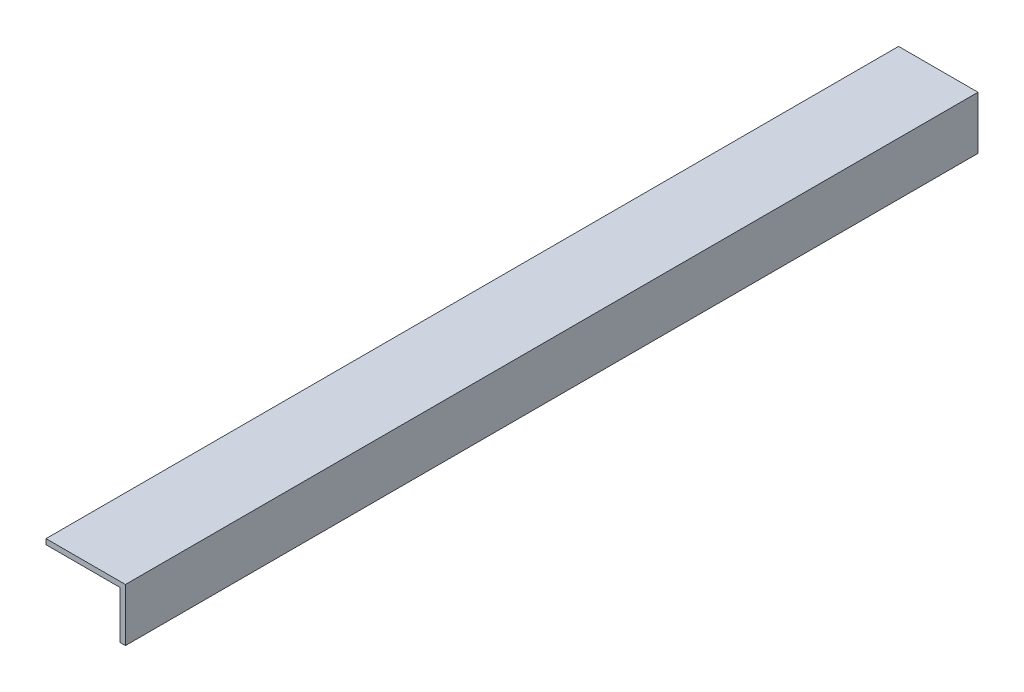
ISO-10303-21;
HEADER;
FILE_DESCRIPTION(('STEP AP214'),'2;1');
FILE_NAME('part.step','',(''),(''),'','','');
FILE_SCHEMA(('AUTOMOTIVE_DESIGN { 1 0 10303 214 1 1 1 1 }'));
ENDSEC;
DATA;
#1=APPLICATION_CONTEXT('core data for automotive mechanical design processes');
#2=APPLICATION_PROTOCOL_DEFINITION('international standard','automotive_design',2000,#1);
#3=PRODUCT_CONTEXT('',#1,'mechanical');
#4=PRODUCT('Part','Part','',(#3));
#5=PRODUCT_RELATED_PRODUCT_CATEGORY('part','',(#4));
#6=PRODUCT_DEFINITION_FORMATION('','',#4);
#7=PRODUCT_DEFINITION_CONTEXT('part definition',#1,'design');
#8=PRODUCT_DEFINITION('design','',#6,#7);
#9=PRODUCT_DEFINITION_SHAPE('','',#8);
#10=(LENGTH_UNIT() NAMED_UNIT(*) SI_UNIT(.MILLI.,.METRE.));
#11=(NAMED_UNIT(*) PLANE_ANGLE_UNIT() SI_UNIT($,.RADIAN.));
#12=(NAMED_UNIT(*) SI_UNIT($,.STERADIAN.) SOLID_ANGLE_UNIT());
#13=UNCERTAINTY_MEASURE_WITH_UNIT(LENGTH_MEASURE(1.E-05),#10,'distance_accuracy_value','');
#14=(GEOMETRIC_REPRESENTATION_CONTEXT(3) GLOBAL_UNCERTAINTY_ASSIGNED_CONTEXT((#13)) GLOBAL_UNIT_ASSIGNED_CONTEXT((#10,
#11,#12)) REPRESENTATION_CONTEXT('',''));
#15=CARTESIAN_POINT('',(0.,0.,0.));
#16=DIRECTION('',(0.,0.,1.));
#17=DIRECTION('',(1.,0.,0.));
#18=AXIS2_PLACEMENT_3D('',#15,#16,#17);
#19=CARTESIAN_POINT('',(0.,0.,161.));
#20=DIRECTION('',(1.,0.,0.));
#21=DIRECTION('',(0.,0.,-1.));
#22=AXIS2_PLACEMENT_3D('',#19,#20,#21);
#23=PLANE('',#22);
#24=DIRECTION('',(0.,-1.,0.));
#25=VECTOR('',#24,1.);
#26=CARTESIAN_POINT('',(0.,0.,0.));
#27=LINE('',#26,#25);
#28=CARTESIAN_POINT('',(0.,10.,0.));
#29=VERTEX_POINT('',#28);
#30=CARTESIAN_POINT('',(0.,9.,0.));
#31=VERTEX_POINT('',#30);
#32=EDGE_CURVE('E103',#29,#31,#27,.T.);
#33=ORIENTED_EDGE('',*,*,#32,.T.);
#34=DIRECTION('',(0.,0.,-1.));
#35=VECTOR('',#34,1.);
#36=CARTESIAN_POINT('',(0.,9.,161.));
#37=LINE('',#36,#35);
#38=CARTESIAN_POINT('',(0.,9.,161.));
#39=VERTEX_POINT('',#38);
#40=EDGE_CURVE('E44',#39,#31,#37,.T.);
#41=ORIENTED_EDGE('',*,*,#40,.F.);
#42=DIRECTION('',(0.,-1.,0.));
#43=VECTOR('',#42,1.);
#44=CARTESIAN_POINT('',(0.,0.,161.));
#45=LINE('',#44,#43);
#46=CARTESIAN_POINT('',(0.,10.,161.));
#47=VERTEX_POINT('',#46);
#48=EDGE_CURVE('E101',#47,#39,#45,.T.);
#49=ORIENTED_EDGE('',*,*,#48,.F.);
#50=DIRECTION('',(0.,0.,-1.));
#51=VECTOR('',#50,1.);
#52=CARTESIAN_POINT('',(0.,10.,161.));
#53=LINE('',#52,#51);
#54=EDGE_CURVE('E115',#47,#29,#53,.T.);
#55=ORIENTED_EDGE('',*,*,#54,.T.);
#56=EDGE_LOOP('',(#33,#41,#49,#55));
#57=FACE_BOUND('',#56,.T.);
#58=ADVANCED_FACE('F30',(#57),#23,.F.);
#59=CARTESIAN_POINT('',(0.,0.,161.));
#60=DIRECTION('',(0.,1.,0.));
#61=DIRECTION('',(0.,0.,1.));
#62=AXIS2_PLACEMENT_3D('',#59,#60,#61);
#63=PLANE('',#62);
#64=DIRECTION('',(1.,0.,0.));
#65=VECTOR('',#64,1.);
#66=CARTESIAN_POINT('',(0.,0.,161.));
#67=LINE('',#66,#65);
#68=CARTESIAN_POINT('',(14.,0.,161.));
#69=VERTEX_POINT('',#68);
#70=CARTESIAN_POINT('',(15.,0.,161.));
#71=VERTEX_POINT('',#70);
#72=EDGE_CURVE('E75',#69,#71,#67,.T.);
#73=ORIENTED_EDGE('',*,*,#72,.F.);
#74=DIRECTION('',(0.,0.,-1.));
#75=VECTOR('',#74,1.);
#76=CARTESIAN_POINT('',(14.,0.,161.));
#77=LINE('',#76,#75);
#78=CARTESIAN_POINT('',(14.,0.,0.));
#79=VERTEX_POINT('',#78);
#80=EDGE_CURVE('E118',#69,#79,#77,.T.);
#81=ORIENTED_EDGE('',*,*,#80,.T.);
#82=DIRECTION('',(1.,0.,0.));
#83=VECTOR('',#82,1.);
#84=CARTESIAN_POINT('',(0.,0.,0.));
#85=LINE('',#84,#83);
#86=CARTESIAN_POINT('',(15.,0.,0.));
#87=VERTEX_POINT('',#86);
#88=EDGE_CURVE('E117',#79,#87,#85,.T.);
#89=ORIENTED_EDGE('',*,*,#88,.T.);
#90=DIRECTION('',(0.,0.,-1.));
#91=VECTOR('',#90,1.);
#92=CARTESIAN_POINT('',(15.,0.,161.));
#93=LINE('',#92,#91);
#94=EDGE_CURVE('E11',#71,#87,#93,.T.);
#95=ORIENTED_EDGE('',*,*,#94,.F.);
#96=EDGE_LOOP('',(#73,#81,#89,#95));
#97=FACE_BOUND('',#96,.T.);
#98=ADVANCED_FACE('F139',(#97),#63,.F.);
#99=CARTESIAN_POINT('',(15.,0.,161.));
#100=DIRECTION('',(-1.,0.,0.));
#101=DIRECTION('',(0.,0.,1.));
#102=AXIS2_PLACEMENT_3D('',#99,#100,#101);
#103=PLANE('',#102);
#104=DIRECTION('',(0.,1.,0.));
#105=VECTOR('',#104,1.);
#106=CARTESIAN_POINT('',(15.,0.,0.));
#107=LINE('',#106,#105);
#108=CARTESIAN_POINT('',(15.,10.,0.));
#109=VERTEX_POINT('',#108);
#110=EDGE_CURVE('E109',#87,#109,#107,.T.);
#111=ORIENTED_EDGE('',*,*,#110,.T.);
#112=DIRECTION('',(0.,0.,-1.));
#113=VECTOR('',#112,1.);
#114=CARTESIAN_POINT('',(15.,10.,161.));
#115=LINE('',#114,#113);
#116=CARTESIAN_POINT('',(15.,10.,161.));
#117=VERTEX_POINT('',#116);
#118=EDGE_CURVE('E37',#117,#109,#115,.T.);
#119=ORIENTED_EDGE('',*,*,#118,.F.);
#120=DIRECTION('',(0.,1.,0.));
#121=VECTOR('',#120,1.);
#122=CARTESIAN_POINT('',(15.,0.,161.));
#123=LINE('',#122,#121);
#124=EDGE_CURVE('E107',#71,#117,#123,.T.);
#125=ORIENTED_EDGE('',*,*,#124,.F.);
#126=ORIENTED_EDGE('',*,*,#94,.T.);
#127=EDGE_LOOP('',(#111,#119,#125,#126));
#128=FACE_BOUND('',#127,.T.);
#129=ADVANCED_FACE('F140',(#128),#103,.F.);
#130=CARTESIAN_POINT('',(0.,10.,161.));
#131=DIRECTION('',(0.,-1.,0.));
#132=DIRECTION('',(0.,0.,-1.));
#133=AXIS2_PLACEMENT_3D('',#130,#131,#132);
#134=PLANE('',#133);
#135=DIRECTION('',(-1.,0.,0.));
#136=VECTOR('',#135,1.);
#137=CARTESIAN_POINT('',(0.,10.,0.));
#138=LINE('',#137,#136);
#139=EDGE_CURVE('E70',#109,#29,#138,.T.);
#140=ORIENTED_EDGE('',*,*,#139,.T.);
#141=ORIENTED_EDGE('',*,*,#54,.F.);
#142=DIRECTION('',(-1.,0.,0.));
#143=VECTOR('',#142,1.);
#144=CARTESIAN_POINT('',(0.,10.,161.));
#145=LINE('',#144,#143);
#146=EDGE_CURVE('E53',#117,#47,#145,.T.);
#147=ORIENTED_EDGE('',*,*,#146,.F.);
#148=ORIENTED_EDGE('',*,*,#118,.T.);
#149=EDGE_LOOP('',(#140,#141,#147,#148));
#150=FACE_BOUND('',#149,.T.);
#151=ADVANCED_FACE('F122',(#150),#134,.F.);
#152=CARTESIAN_POINT('',(0.,10.,161.));
#153=DIRECTION('',(0.,0.,-1.));
#154=DIRECTION('',(-1.,0.,0.));
#155=AXIS2_PLACEMENT_3D('',#152,#153,#154);
#156=PLANE('',#155);
#157=DIRECTION('',(1.,0.,0.));
#158=VECTOR('',#157,1.);
#159=CARTESIAN_POINT('',(0.,9.,161.));
#160=LINE('',#159,#158);
#161=CARTESIAN_POINT('',(14.,9.,161.));
#162=VERTEX_POINT('',#161);
#163=EDGE_CURVE('E91',#39,#162,#160,.T.);
#164=ORIENTED_EDGE('',*,*,#163,.T.);
#165=DIRECTION('',(0.,-1.,0.));
#166=VECTOR('',#165,1.);
#167=CARTESIAN_POINT('',(14.,0.,161.));
#168=LINE('',#167,#166);
#169=EDGE_CURVE('E95',#162,#69,#168,.T.);
#170=ORIENTED_EDGE('',*,*,#169,.T.);
#171=ORIENTED_EDGE('',*,*,#72,.T.);
#172=ORIENTED_EDGE('',*,*,#124,.T.);
#173=ORIENTED_EDGE('',*,*,#146,.T.);
#174=ORIENTED_EDGE('',*,*,#48,.T.);
#175=EDGE_LOOP('',(#164,#170,#171,#172,#173,#174));
#176=FACE_BOUND('',#175,.T.);
#177=ADVANCED_FACE('F105',(#176),#156,.F.);
#178=CARTESIAN_POINT('',(0.,10.,0.));
#179=DIRECTION('',(0.,0.,-1.));
#180=DIRECTION('',(-1.,0.,0.));
#181=AXIS2_PLACEMENT_3D('',#178,#179,#180);
#182=PLANE('',#181);
#183=DIRECTION('',(0.,-1.,0.));
#184=VECTOR('',#183,1.);
#185=CARTESIAN_POINT('',(14.,0.,0.));
#186=LINE('',#185,#184);
#187=CARTESIAN_POINT('',(14.,9.,0.));
#188=VERTEX_POINT('',#187);
#189=EDGE_CURVE('E96',#188,#79,#186,.T.);
#190=ORIENTED_EDGE('',*,*,#189,.F.);
#191=DIRECTION('',(1.,0.,0.));
#192=VECTOR('',#191,1.);
#193=CARTESIAN_POINT('',(0.,9.,0.));
#194=LINE('',#193,#192);
#195=EDGE_CURVE('E130',#31,#188,#194,.T.);
#196=ORIENTED_EDGE('',*,*,#195,.F.);
#197=ORIENTED_EDGE('',*,*,#32,.F.);
#198=ORIENTED_EDGE('',*,*,#139,.F.);
#199=ORIENTED_EDGE('',*,*,#110,.F.);
#200=ORIENTED_EDGE('',*,*,#88,.F.);
#201=EDGE_LOOP('',(#190,#196,#197,#198,#199,#200));
#202=FACE_BOUND('',#201,.T.);
#203=ADVANCED_FACE('F128',(#202),#182,.T.);
#204=CARTESIAN_POINT('',(14.,0.,161.));
#205=DIRECTION('',(1.,0.,0.));
#206=DIRECTION('',(0.,0.,-1.));
#207=AXIS2_PLACEMENT_3D('',#204,#205,#206);
#208=PLANE('',#207);
#209=ORIENTED_EDGE('',*,*,#189,.T.);
#210=ORIENTED_EDGE('',*,*,#80,.F.);
#211=ORIENTED_EDGE('',*,*,#169,.F.);
#212=DIRECTION('',(0.,0.,-1.));
#213=VECTOR('',#212,1.);
#214=CARTESIAN_POINT('',(14.,9.,161.));
#215=LINE('',#214,#213);
#216=EDGE_CURVE('E93',#162,#188,#215,.T.);
#217=ORIENTED_EDGE('',*,*,#216,.T.);
#218=EDGE_LOOP('',(#209,#210,#211,#217));
#219=FACE_BOUND('',#218,.T.);
#220=ADVANCED_FACE('F137',(#219),#208,.F.);
#221=CARTESIAN_POINT('',(0.,9.,161.));
#222=DIRECTION('',(0.,1.,0.));
#223=DIRECTION('',(-1.,0.,0.));
#224=AXIS2_PLACEMENT_3D('',#221,#222,#223);
#225=PLANE('',#224);
#226=ORIENTED_EDGE('',*,*,#195,.T.);
#227=ORIENTED_EDGE('',*,*,#216,.F.);
#228=ORIENTED_EDGE('',*,*,#163,.F.);
#229=ORIENTED_EDGE('',*,*,#40,.T.);
#230=EDGE_LOOP('',(#226,#227,#228,#229));
#231=FACE_BOUND('',#230,.T.);
#232=ADVANCED_FACE('F92',(#231),#225,.F.);
#233=CLOSED_SHELL('',(#58,#98,#129,#151,#177,#203,#220,#232));
#234=MANIFOLD_SOLID_BREP('B2',#233);
#235=ADVANCED_BREP_SHAPE_REPRESENTATION('',(#18,#234),#14);
#236=SHAPE_DEFINITION_REPRESENTATION(#9,#235);
ENDSEC;
END-ISO-10303-21;
